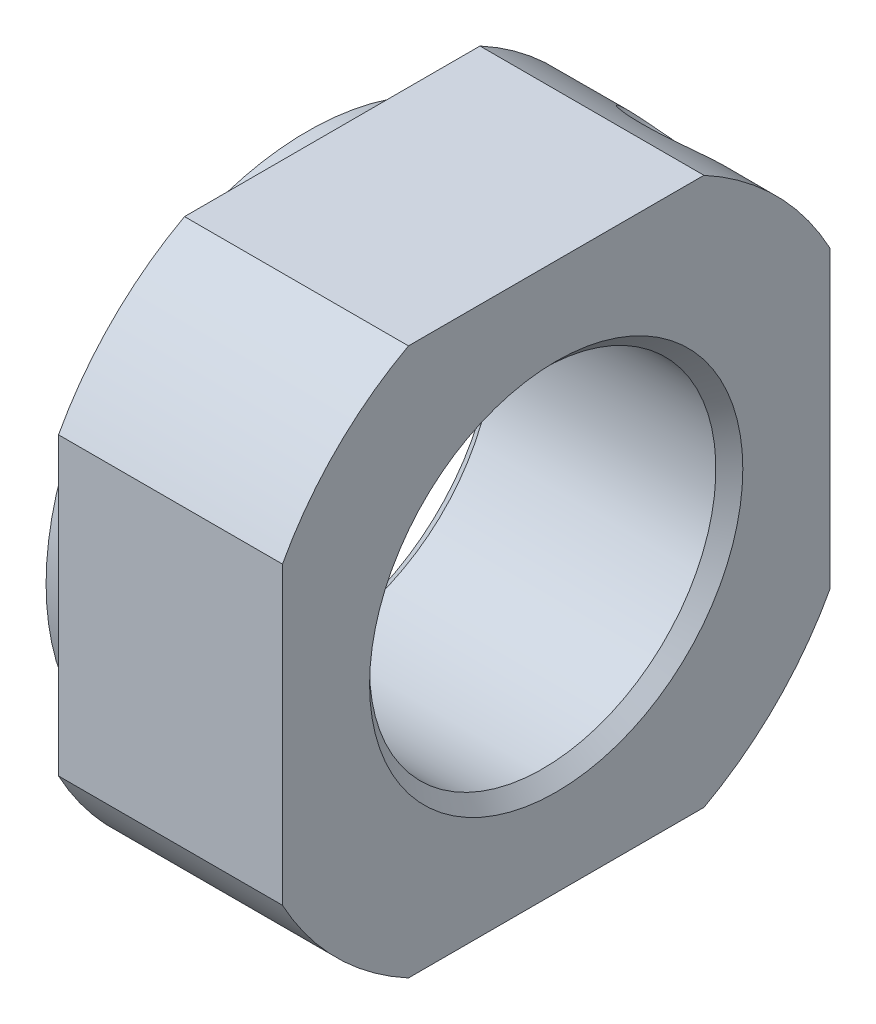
ISO-10303-21;
HEADER;
FILE_DESCRIPTION(('STEP AP214'),'2;1');
FILE_NAME('part.step','',(''),(''),'','','');
FILE_SCHEMA(('AUTOMOTIVE_DESIGN { 1 0 10303 214 1 1 1 1 }'));
ENDSEC;
DATA;
#1=APPLICATION_CONTEXT('core data for automotive mechanical design processes');
#2=APPLICATION_PROTOCOL_DEFINITION('international standard','automotive_design',2000,#1);
#3=PRODUCT_CONTEXT('',#1,'mechanical');
#4=PRODUCT('Part','Part','',(#3));
#5=PRODUCT_RELATED_PRODUCT_CATEGORY('part','',(#4));
#6=PRODUCT_DEFINITION_FORMATION('','',#4);
#7=PRODUCT_DEFINITION_CONTEXT('part definition',#1,'design');
#8=PRODUCT_DEFINITION('design','',#6,#7);
#9=PRODUCT_DEFINITION_SHAPE('','',#8);
#10=(LENGTH_UNIT() NAMED_UNIT(*) SI_UNIT(.MILLI.,.METRE.));
#11=(NAMED_UNIT(*) PLANE_ANGLE_UNIT() SI_UNIT($,.RADIAN.));
#12=(NAMED_UNIT(*) SI_UNIT($,.STERADIAN.) SOLID_ANGLE_UNIT());
#13=UNCERTAINTY_MEASURE_WITH_UNIT(LENGTH_MEASURE(1.E-05),#10,'distance_accuracy_value','');
#14=(GEOMETRIC_REPRESENTATION_CONTEXT(3) GLOBAL_UNCERTAINTY_ASSIGNED_CONTEXT((#13)) GLOBAL_UNIT_ASSIGNED_CONTEXT((#10,
#11,#12)) REPRESENTATION_CONTEXT('',''));
#15=CARTESIAN_POINT('',(0.,0.,0.));
#16=DIRECTION('',(0.,0.,1.));
#17=DIRECTION('',(1.,0.,0.));
#18=AXIS2_PLACEMENT_3D('',#15,#16,#17);
#19=CARTESIAN_POINT('',(9.,1.51441359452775E-12,-1.51441359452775E-12));
#20=DIRECTION('',(-1.,0.,0.));
#21=DIRECTION('',(0.,0.,1.));
#22=AXIS2_PLACEMENT_3D('',#19,#20,#21);
#23=CYLINDRICAL_SURFACE('',#22,12.499999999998);
#24=CARTESIAN_POINT('',(0.,1.51441359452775E-12,-1.51441359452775E-12));
#25=DIRECTION('',(1.,0.,0.));
#26=DIRECTION('',(0.,0.,-1.));
#27=AXIS2_PLACEMENT_3D('',#24,#25,#26);
#28=CIRCLE('',#27,12.499999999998);
#29=CARTESIAN_POINT('',(0.,5.937171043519,-11.));
#30=VERTEX_POINT('',#29);
#31=CARTESIAN_POINT('',(0.,11.,-5.937171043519));
#32=VERTEX_POINT('',#31);
#33=EDGE_CURVE('E148',#30,#32,#28,.T.);
#34=ORIENTED_EDGE('',*,*,#33,.T.);
#35=DIRECTION('',(-1.,0.,0.));
#36=VECTOR('',#35,1.);
#37=CARTESIAN_POINT('',(9.,11.,-5.937171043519));
#38=LINE('',#37,#36);
#39=CARTESIAN_POINT('',(9.,11.,-5.937171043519));
#40=VERTEX_POINT('',#39);
#41=EDGE_CURVE('E129',#40,#32,#38,.T.);
#42=ORIENTED_EDGE('',*,*,#41,.F.);
#43=CARTESIAN_POINT('',(9.,1.51441359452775E-12,-1.51441359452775E-12));
#44=DIRECTION('',(1.,0.,0.));
#45=DIRECTION('',(0.,0.,-1.));
#46=AXIS2_PLACEMENT_3D('',#43,#44,#45);
#47=CIRCLE('',#46,12.499999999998);
#48=CARTESIAN_POINT('',(9.,5.937171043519,-11.));
#49=VERTEX_POINT('',#48);
#50=EDGE_CURVE('E120',#49,#40,#47,.T.);
#51=ORIENTED_EDGE('',*,*,#50,.F.);
#52=DIRECTION('',(-1.,0.,0.));
#53=VECTOR('',#52,1.);
#54=CARTESIAN_POINT('',(9.,5.937171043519,-11.));
#55=LINE('',#54,#53);
#56=EDGE_CURVE('E157',#49,#30,#55,.T.);
#57=ORIENTED_EDGE('',*,*,#56,.T.);
#58=EDGE_LOOP('',(#34,#42,#51,#57));
#59=FACE_BOUND('',#58,.T.);
#60=CARTESIAN_POINT('',(3.46908361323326,7.95264681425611,-9.64393119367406));
#61=CARTESIAN_POINT('',(3.40467004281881,8.00792620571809,-9.59834578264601));
#62=CARTESIAN_POINT('',(3.34564206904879,8.06656085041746,-9.54919380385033));
#63=CARTESIAN_POINT('',(3.24011485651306,8.18908332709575,-9.44433226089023));
#64=CARTESIAN_POINT('',(3.19361898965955,8.25297256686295,-9.38862093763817));
#65=CARTESIAN_POINT('',(3.11154773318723,8.3896574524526,-9.26675132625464));
#66=CARTESIAN_POINT('',(3.07717708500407,8.46275411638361,-9.20011123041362));
#67=CARTESIAN_POINT('',(3.02658994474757,8.61057411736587,-9.06191119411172));
#68=CARTESIAN_POINT('',(3.01037050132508,8.68529718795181,-8.99035205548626));
#69=CARTESIAN_POINT('',(2.99727678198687,8.82925457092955,-8.84894488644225));
#70=CARTESIAN_POINT('',(2.9992870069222,8.89854652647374,-8.77925705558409));
#71=CARTESIAN_POINT('',(3.01991095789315,9.03424429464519,-8.6395549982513));
#72=CARTESIAN_POINT('',(3.03852197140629,9.10065057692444,-8.56954082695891));
#73=CARTESIAN_POINT('',(3.09114037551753,9.22787856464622,-8.4323714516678));
#74=CARTESIAN_POINT('',(3.12491139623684,9.2887693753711,-8.36518905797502));
#75=CARTESIAN_POINT('',(3.2064808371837,9.40481510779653,-8.2345066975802));
#76=CARTESIAN_POINT('',(3.25428157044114,9.45996908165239,-8.17100734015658));
#77=CARTESIAN_POINT('',(3.36464570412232,9.56591245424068,-8.04675590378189));
#78=CARTESIAN_POINT('',(3.42776164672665,9.61640692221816,-7.98624412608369));
#79=CARTESIAN_POINT('',(3.56547677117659,9.70955437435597,-7.87273503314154));
#80=CARTESIAN_POINT('',(3.64007942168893,9.75220498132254,-7.81973999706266));
#81=CARTESIAN_POINT('',(3.80440573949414,9.83208195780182,-7.71910572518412));
#82=CARTESIAN_POINT('',(3.89483142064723,9.86869657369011,-7.67212695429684));
#83=CARTESIAN_POINT('',(4.0839273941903,9.93227515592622,-7.58963960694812));
#84=CARTESIAN_POINT('',(4.18260011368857,9.95923626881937,-7.55413442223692));
#85=CARTESIAN_POINT('',(4.39198343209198,10.0047792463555,-7.49372559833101));
#86=CARTESIAN_POINT('',(4.50306103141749,10.0227352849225,-7.46961915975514));
#87=CARTESIAN_POINT('',(4.72862562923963,10.0475890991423,-7.43615418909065));
#88=CARTESIAN_POINT('',(4.84311327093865,10.0544847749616,-7.42679845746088));
#89=CARTESIAN_POINT('',(5.07613773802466,10.0572440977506,-7.42306221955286));
#90=CARTESIAN_POINT('',(5.19468713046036,10.0527484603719,-7.42916941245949));
#91=CARTESIAN_POINT('',(5.42885975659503,10.0319682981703,-7.45720532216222));
#92=CARTESIAN_POINT('',(5.5444827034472,10.0156826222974,-7.47913558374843));
#93=CARTESIAN_POINT('',(5.76975125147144,9.97130609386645,-7.53819713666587));
#94=CARTESIAN_POINT('',(5.87938099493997,9.94318548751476,-7.57536673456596));
#95=CARTESIAN_POINT('',(6.08897354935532,9.87524630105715,-7.66371989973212));
#96=CARTESIAN_POINT('',(6.188936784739,9.83542823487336,-7.71490285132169));
#97=CARTESIAN_POINT('',(6.37316871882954,9.74565608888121,-7.82797788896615));
#98=CARTESIAN_POINT('',(6.45779800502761,9.69601643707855,-7.88953064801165));
#99=CARTESIAN_POINT('',(6.61153742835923,9.58651968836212,-8.02221974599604));
#100=CARTESIAN_POINT('',(6.68065399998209,9.52666684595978,-8.09335209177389));
#101=CARTESIAN_POINT('',(6.79655056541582,9.40193061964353,-8.23785235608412));
#102=CARTESIAN_POINT('',(6.84447329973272,9.33761087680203,-8.31078893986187));
#103=CARTESIAN_POINT('',(6.92193488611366,9.20240844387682,-8.46024810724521));
#104=CARTESIAN_POINT('',(6.95148440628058,9.13152958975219,-8.53676858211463));
#105=CARTESIAN_POINT('',(6.98927821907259,8.99074769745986,-8.68482040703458));
#106=CARTESIAN_POINT('',(6.99895058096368,8.9211681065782,-8.75629689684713));
#107=CARTESIAN_POINT('',(7.00088650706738,8.78018692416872,-8.89765535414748));
#108=CARTESIAN_POINT('',(6.99315434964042,8.70878578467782,-8.96753770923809));
#109=CARTESIAN_POINT('',(6.96123166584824,8.56896839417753,-9.10119832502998));
#110=CARTESIAN_POINT('',(6.93764108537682,8.50053689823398,-9.16510560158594));
#111=CARTESIAN_POINT('',(6.87558226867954,8.36607288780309,-9.28800997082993));
#112=CARTESIAN_POINT('',(6.83711283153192,8.3000405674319,-9.34700666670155));
#113=CARTESIAN_POINT('',(6.74553023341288,8.17057068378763,-9.46041129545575));
#114=CARTESIAN_POINT('',(6.69206179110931,8.10724548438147,-9.51465970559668));
#115=CARTESIAN_POINT('',(6.57276726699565,7.98681462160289,-9.61597617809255));
#116=CARTESIAN_POINT('',(6.50693784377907,7.92971064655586,-9.66304229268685));
#117=CARTESIAN_POINT('',(6.36009559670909,7.81960814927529,-9.75238919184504));
#118=CARTESIAN_POINT('',(6.27836099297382,7.76714103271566,-9.79413807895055));
#119=CARTESIAN_POINT('',(6.10542346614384,7.67236660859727,-9.86855766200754));
#120=CARTESIAN_POINT('',(6.01421755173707,7.63006252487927,-9.90122547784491));
#121=CARTESIAN_POINT('',(5.81815804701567,7.55418170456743,-9.95925636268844));
#122=CARTESIAN_POINT('',(5.7127969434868,7.52140932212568,-9.9839592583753));
#123=CARTESIAN_POINT('',(5.49685331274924,7.46969192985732,-10.0227117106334));
#124=CARTESIAN_POINT('',(5.38626972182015,7.45074975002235,-10.0367590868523));
#125=CARTESIAN_POINT('',(5.15798077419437,7.42674360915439,-10.0545373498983));
#126=CARTESIAN_POINT('',(5.04017274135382,7.42230542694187,-10.0578031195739));
#127=CARTESIAN_POINT('',(4.80524572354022,7.42920786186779,-10.052705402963));
#128=CARTESIAN_POINT('',(4.68812692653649,7.44055259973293,-10.0443388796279));
#129=CARTESIAN_POINT('',(4.45647137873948,7.47889914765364,-10.0158196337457));
#130=CARTESIAN_POINT('',(4.3419829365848,7.50608851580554,-9.99552569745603));
#131=CARTESIAN_POINT('',(4.12050810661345,7.57539551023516,-9.94310112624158));
#132=CARTESIAN_POINT('',(4.01351714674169,7.61750394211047,-9.91097778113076));
#133=CARTESIAN_POINT('',(3.82982934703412,7.7059006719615,-9.8423363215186));
#134=CARTESIAN_POINT('',(3.75124686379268,7.74985945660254,-9.80782538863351));
#135=CARTESIAN_POINT('',(3.60301893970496,7.84564968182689,-9.7313684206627));
#136=CARTESIAN_POINT('',(3.53336917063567,7.89747728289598,-9.68942601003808));
#137=CARTESIAN_POINT('',(3.46908361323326,7.95264681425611,-9.64393119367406));
#138=B_SPLINE_CURVE_WITH_KNOTS('',3,(#60,#61,#62,#63,#64,#65,#66,#67,#68,#69,#70,#71,#72,#73,
#74,#75,#76,#77,#78,#79,#80,#81,#82,#83,#84,#85,#86,#87,#88,#89,#90,#91,#92,#93,#94,#95,#96,#97,
#98,#99,#100,#101,#102,#103,#104,#105,#106,#107,#108,#109,#110,#111,#112,#113,#114,#115,#116,
#117,#118,#119,#120,#121,#122,#123,#124,#125,#126,#127,#128,#129,#130,#131,#132,#133,#134,#135,
#136,#137),.UNSPECIFIED.,.T.,.F.,(4,2,2,2,2,2,2,2,2,2,2,2,2,2,2,2,2,2,2,2,2,2,2,2,2,2,2,2,2,2,2,
2,2,2,2,2,2,2,4),(0.,0.288765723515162,0.577609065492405,0.890084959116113,1.20251003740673,
1.49595279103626,1.78934760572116,2.07831875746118,2.36733757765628,2.66895099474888,
2.97065566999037,3.29408589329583,3.61761163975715,3.96126974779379,4.30499309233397,
4.65969156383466,5.01442466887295,5.37005497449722,5.72566965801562,6.07134432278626,
6.41687533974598,6.74038698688,7.06371061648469,7.36285406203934,7.66192398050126,
7.95027266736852,8.23864463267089,8.53452681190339,8.83048908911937,9.14628085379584,
9.46217265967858,9.79987742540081,10.137651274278,10.4898184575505,10.8420776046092,
11.1985937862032,11.554890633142,11.8432227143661,12.1314145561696),.UNSPECIFIED.);
#139=CARTESIAN_POINT('',(3.46908361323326,7.95264681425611,-9.64393119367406));
#140=VERTEX_POINT('',#139);
#141=EDGE_CURVE('E11',#140,#140,#138,.T.);
#142=ORIENTED_EDGE('',*,*,#141,.F.);
#143=EDGE_LOOP('',(#142));
#144=FACE_BOUND('',#143,.T.);
#145=ADVANCED_FACE('F35',(#59,#144),#23,.T.);
#146=CARTESIAN_POINT('',(9.,0.,0.));
#147=DIRECTION('',(-1.,0.,0.));
#148=DIRECTION('',(0.,0.,1.));
#149=AXIS2_PLACEMENT_3D('',#146,#147,#148);
#150=CYLINDRICAL_SURFACE('',#149,6.9585);
#151=CARTESIAN_POINT('',(8.4585,0.,0.));
#152=DIRECTION('',(-1.,0.,0.));
#153=DIRECTION('',(0.,0.,1.));
#154=AXIS2_PLACEMENT_3D('',#151,#152,#153);
#155=CIRCLE('',#154,6.9585);
#156=CARTESIAN_POINT('',(8.4585,0.,6.9585));
#157=VERTEX_POINT('',#156);
#158=EDGE_CURVE('E251',#157,#157,#155,.T.);
#159=ORIENTED_EDGE('',*,*,#158,.F.);
#160=EDGE_LOOP('',(#159));
#161=FACE_BOUND('',#160,.T.);
#162=CARTESIAN_POINT('',(-0.458500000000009,0.,0.));
#163=DIRECTION('',(-1.,0.,0.));
#164=DIRECTION('',(0.,0.,1.));
#165=AXIS2_PLACEMENT_3D('',#162,#163,#164);
#166=CIRCLE('',#165,6.9585);
#167=CARTESIAN_POINT('',(-0.458500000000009,0.,6.9585));
#168=VERTEX_POINT('',#167);
#169=EDGE_CURVE('E248',#168,#168,#166,.T.);
#170=ORIENTED_EDGE('',*,*,#169,.T.);
#171=EDGE_LOOP('',(#170));
#172=FACE_BOUND('',#171,.T.);
#173=CARTESIAN_POINT('',(5.,5.9312530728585,-3.6388128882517));
#174=CARTESIAN_POINT('',(5.08971664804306,5.93125231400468,-3.6388161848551));
#175=CARTESIAN_POINT('',(5.17946651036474,5.92724379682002,-3.64537288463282));
#176=CARTESIAN_POINT('',(5.35640295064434,5.91122841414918,-3.6712837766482));
#177=CARTESIAN_POINT('',(5.44358779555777,5.89921626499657,-3.690646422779));
#178=CARTESIAN_POINT('',(5.61280930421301,5.86728246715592,-3.74120372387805));
#179=CARTESIAN_POINT('',(5.69485191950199,5.84737016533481,-3.77238439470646));
#180=CARTESIAN_POINT('',(5.8517165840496,5.79975796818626,-3.8451805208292));
#181=CARTESIAN_POINT('',(5.9265385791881,5.77205801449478,-3.88679605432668));
#182=CARTESIAN_POINT('',(6.06827015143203,5.7085117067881,-3.97955052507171));
#183=CARTESIAN_POINT('',(6.13502132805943,5.67253331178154,-4.0308410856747));
#184=CARTESIAN_POINT('',(6.25732556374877,5.59302662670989,-4.14045307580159));
#185=CARTESIAN_POINT('',(6.31287767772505,5.54949770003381,-4.19877509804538));
#186=CARTESIAN_POINT('',(6.4118429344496,5.45485132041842,-4.32103665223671));
#187=CARTESIAN_POINT('',(6.45510228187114,5.40364901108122,-4.38503523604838));
#188=CARTESIAN_POINT('',(6.52725685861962,5.29492946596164,-4.51571234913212));
#189=CARTESIAN_POINT('',(6.55615392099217,5.23741303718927,-4.58239053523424));
#190=CARTESIAN_POINT('',(6.59826139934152,5.11840868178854,-4.71491273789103));
#191=CARTESIAN_POINT('',(6.61174031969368,5.05700903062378,-4.78075063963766));
#192=CARTESIAN_POINT('',(6.62346985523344,4.93096749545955,-4.91064832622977));
#193=CARTESIAN_POINT('',(6.62172243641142,4.86632603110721,-4.97470833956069));
#194=CARTESIAN_POINT('',(6.60324586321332,4.73700366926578,-5.09797503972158));
#195=CARTESIAN_POINT('',(6.58680629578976,4.67234757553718,-5.1572515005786));
#196=CARTESIAN_POINT('',(6.53987530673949,4.54380101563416,-5.2708592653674));
#197=CARTESIAN_POINT('',(6.50938319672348,4.47991058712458,-5.32519032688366));
#198=CARTESIAN_POINT('',(6.43496623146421,4.35448023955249,-5.42824764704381));
#199=CARTESIAN_POINT('',(6.39093457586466,4.29296355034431,-5.47692494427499));
#200=CARTESIAN_POINT('',(6.29076862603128,4.17493704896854,-5.56741969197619));
#201=CARTESIAN_POINT('',(6.2346324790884,4.11842800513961,-5.60923609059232));
#202=CARTESIAN_POINT('',(6.11028484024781,4.01119319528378,-5.68643347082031));
#203=CARTESIAN_POINT('',(6.04182001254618,3.96063505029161,-5.72163962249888));
#204=CARTESIAN_POINT('',(5.89557880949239,3.86891076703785,-5.78405902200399));
#205=CARTESIAN_POINT('',(5.81780210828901,3.82774495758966,-5.81127199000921));
#206=CARTESIAN_POINT('',(5.65471709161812,3.75646407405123,-5.85760381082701));
#207=CARTESIAN_POINT('',(5.5693817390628,3.72639083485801,-5.87669206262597));
#208=CARTESIAN_POINT('',(5.39385539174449,3.67896259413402,-5.90650061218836));
#209=CARTESIAN_POINT('',(5.30366528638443,3.66160527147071,-5.91722243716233));
#210=CARTESIAN_POINT('',(5.12321679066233,3.64073872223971,-5.93008363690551));
#211=CARTESIAN_POINT('',(5.03300787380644,3.63691957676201,-5.93241510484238));
#212=CARTESIAN_POINT('',(4.85315379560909,3.64245841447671,-5.92901588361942));
#213=CARTESIAN_POINT('',(4.7635085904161,3.65181535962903,-5.92328582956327));
#214=CARTESIAN_POINT('',(4.58859834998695,3.68301308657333,-5.90393619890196));
#215=CARTESIAN_POINT('',(4.50329000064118,3.70468021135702,-5.89042633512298));
#216=CARTESIAN_POINT('',(4.33805243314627,3.75935494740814,-5.85568230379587));
#217=CARTESIAN_POINT('',(4.25812378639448,3.79236376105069,-5.83444731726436));
#218=CARTESIAN_POINT('',(4.10439241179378,3.86895651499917,-5.78394590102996));
#219=CARTESIAN_POINT('',(4.03071936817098,3.91271329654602,-5.75454706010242));
#220=CARTESIAN_POINT('',(3.8929690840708,4.0087064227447,-5.68809243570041));
#221=CARTESIAN_POINT('',(3.82889320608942,4.06094396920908,-5.65103556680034));
#222=CARTESIAN_POINT('',(3.71075199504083,4.17311563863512,-5.5687306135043));
#223=CARTESIAN_POINT('',(3.65693025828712,4.23319055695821,-5.52332419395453));
#224=CARTESIAN_POINT('',(3.56257895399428,4.35788661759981,-5.42547857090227));
#225=CARTESIAN_POINT('',(3.52204872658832,4.42250753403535,-5.37303971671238));
#226=CARTESIAN_POINT('',(3.45575694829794,4.5535250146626,-5.26245411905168));
#227=CARTESIAN_POINT('',(3.42989539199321,4.61990624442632,-5.20434927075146));
#228=CARTESIAN_POINT('',(3.39336744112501,4.7525912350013,-5.08346779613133));
#229=CARTESIAN_POINT('',(3.38269852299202,4.81889500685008,-5.02069194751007));
#230=CARTESIAN_POINT('',(3.3769848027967,4.94775316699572,-4.89371559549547));
#231=CARTESIAN_POINT('',(3.38157822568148,5.01035907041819,-4.82958338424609));
#232=CARTESIAN_POINT('',(3.40544105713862,5.13172444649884,-4.70042348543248));
#233=CARTESIAN_POINT('',(3.42471012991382,5.19048400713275,-4.63539581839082));
#234=CARTESIAN_POINT('',(3.477194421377,5.30252971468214,-4.50678948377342));
#235=CARTESIAN_POINT('',(3.51035206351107,5.35583734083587,-4.44320596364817));
#236=CARTESIAN_POINT('',(3.58961834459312,5.4562538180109,-4.31930359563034));
#237=CARTESIAN_POINT('',(3.63572841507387,5.50336198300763,-4.25898510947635));
#238=CARTESIAN_POINT('',(3.74073681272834,5.59162963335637,-4.14244647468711));
#239=CARTESIAN_POINT('',(3.79988571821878,5.63264169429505,-4.08634043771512));
#240=CARTESIAN_POINT('',(3.92879553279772,5.70705354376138,-3.98175728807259));
#241=CARTESIAN_POINT('',(3.99855904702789,5.7404514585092,-3.93328205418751));
#242=CARTESIAN_POINT('',(4.14802947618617,5.7998157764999,-3.84522179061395));
#243=CARTESIAN_POINT('',(4.22787470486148,5.82565793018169,-3.80578747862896));
#244=CARTESIAN_POINT('',(4.39440005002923,5.86900826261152,-3.73859265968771));
#245=CARTESIAN_POINT('',(4.48107466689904,5.88652306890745,-3.71082287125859));
#246=CARTESIAN_POINT('',(4.639781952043,5.91028996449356,-3.67281603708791));
#247=CARTESIAN_POINT('',(4.71099521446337,5.91814737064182,-3.66010292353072));
#248=CARTESIAN_POINT('',(4.85479845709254,5.92862906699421,-3.64310028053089));
#249=CARTESIAN_POINT('',(4.92738835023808,5.93125368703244,-3.63881022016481));
#250=CARTESIAN_POINT('',(5.,5.9312530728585,-3.6388128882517));
#251=B_SPLINE_CURVE_WITH_KNOTS('',3,(#173,#174,#175,#176,#177,#178,#179,#180,#181,#182,#183,
#184,#185,#186,#187,#188,#189,#190,#191,#192,#193,#194,#195,#196,#197,#198,#199,#200,#201,#202,
#203,#204,#205,#206,#207,#208,#209,#210,#211,#212,#213,#214,#215,#216,#217,#218,#219,#220,#221,
#222,#223,#224,#225,#226,#227,#228,#229,#230,#231,#232,#233,#234,#235,#236,#237,#238,#239,#240,
#241,#242,#243,#244,#245,#246,#247,#248,#249,#250),.UNSPECIFIED.,.T.,.F.,(4,2,2,2,2,2,2,2,2,2,2,
2,2,2,2,2,2,2,2,2,2,2,2,2,2,2,2,2,2,2,2,2,2,2,2,2,2,2,4),(0.,0.268883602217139,
0.537944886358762,0.806688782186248,1.07543469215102,1.34880742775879,1.62220322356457,
1.89888236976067,2.17552619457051,2.44727523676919,2.71898919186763,2.98546288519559,
3.25194963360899,3.52059483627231,3.78928118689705,4.06429779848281,4.33932403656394,
4.61537716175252,4.8913798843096,5.16102196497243,5.43064280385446,5.69655137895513,
5.96248815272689,6.23301917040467,6.50358855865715,6.77994869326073,7.05629510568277,
7.33073412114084,7.60512754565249,7.87306364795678,8.1409936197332,8.40782368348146,
8.67468324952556,8.94720494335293,9.21979363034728,9.49664082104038,9.77326730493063,
9.99090041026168,10.2085197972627),.UNSPECIFIED.);
#252=CARTESIAN_POINT('',(5.,5.9312530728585,-3.6388128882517));
#253=VERTEX_POINT('',#252);
#254=EDGE_CURVE('E169',#253,#253,#251,.T.);
#255=ORIENTED_EDGE('',*,*,#254,.T.);
#256=EDGE_LOOP('',(#255));
#257=FACE_BOUND('',#256,.T.);
#258=ADVANCED_FACE('F177',(#161,#172,#257),#150,.F.);
#259=CARTESIAN_POINT('',(9.,1.51441359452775E-12,-1.51441359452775E-12));
#260=DIRECTION('',(1.,0.,0.));
#261=DIRECTION('',(0.,0.,-1.));
#262=AXIS2_PLACEMENT_3D('',#259,#260,#261);
#263=PLANE('',#262);
#264=CARTESIAN_POINT('',(9.,1.51441359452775E-12,-1.51441359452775E-12));
#265=DIRECTION('',(1.,0.,0.));
#266=DIRECTION('',(0.,0.,-1.));
#267=AXIS2_PLACEMENT_3D('',#264,#265,#266);
#268=CIRCLE('',#267,12.5000000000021);
#269=CARTESIAN_POINT('',(9.,-5.937171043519,11.));
#270=VERTEX_POINT('',#269);
#271=CARTESIAN_POINT('',(9.,-11.,5.937171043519));
#272=VERTEX_POINT('',#271);
#273=EDGE_CURVE('E153',#270,#272,#268,.T.);
#274=ORIENTED_EDGE('',*,*,#273,.T.);
#275=DIRECTION('',(0.,0.,-1.));
#276=VECTOR('',#275,1.);
#277=CARTESIAN_POINT('',(9.,-11.,5.937171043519));
#278=LINE('',#277,#276);
#279=CARTESIAN_POINT('',(9.,-10.9999999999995,-5.9371710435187));
#280=VERTEX_POINT('',#279);
#281=EDGE_CURVE('E100',#272,#280,#278,.T.);
#282=ORIENTED_EDGE('',*,*,#281,.T.);
#283=CARTESIAN_POINT('',(9.,1.51441359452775E-12,-1.51441359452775E-12));
#284=DIRECTION('',(1.,0.,0.));
#285=DIRECTION('',(0.,0.,-1.));
#286=AXIS2_PLACEMENT_3D('',#283,#284,#285);
#287=CIRCLE('',#286,12.5);
#288=CARTESIAN_POINT('',(9.,-5.937171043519,-11.));
#289=VERTEX_POINT('',#288);
#290=EDGE_CURVE('E231',#280,#289,#287,.T.);
#291=ORIENTED_EDGE('',*,*,#290,.T.);
#292=DIRECTION('',(0.,1.,0.));
#293=VECTOR('',#292,1.);
#294=CARTESIAN_POINT('',(9.,-5.937171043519,-11.));
#295=LINE('',#294,#293);
#296=EDGE_CURVE('E237',#289,#49,#295,.T.);
#297=ORIENTED_EDGE('',*,*,#296,.T.);
#298=ORIENTED_EDGE('',*,*,#50,.T.);
#299=DIRECTION('',(0.,0.,1.));
#300=VECTOR('',#299,1.);
#301=CARTESIAN_POINT('',(9.,11.,-5.937171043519));
#302=LINE('',#301,#300);
#303=CARTESIAN_POINT('',(9.,11.0000000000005,5.93717104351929));
#304=VERTEX_POINT('',#303);
#305=EDGE_CURVE('E113',#40,#304,#302,.T.);
#306=ORIENTED_EDGE('',*,*,#305,.T.);
#307=CARTESIAN_POINT('',(9.,1.51441359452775E-12,-1.51441359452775E-12));
#308=DIRECTION('',(1.,0.,0.));
#309=DIRECTION('',(0.,0.,-1.));
#310=AXIS2_PLACEMENT_3D('',#307,#308,#309);
#311=CIRCLE('',#310,12.5);
#312=CARTESIAN_POINT('',(9.,5.937171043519,11.));
#313=VERTEX_POINT('',#312);
#314=EDGE_CURVE('E118',#304,#313,#311,.T.);
#315=ORIENTED_EDGE('',*,*,#314,.T.);
#316=DIRECTION('',(0.,-1.,0.));
#317=VECTOR('',#316,1.);
#318=CARTESIAN_POINT('',(9.,5.937171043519,11.));
#319=LINE('',#318,#317);
#320=EDGE_CURVE('E56',#313,#270,#319,.T.);
#321=ORIENTED_EDGE('',*,*,#320,.T.);
#322=EDGE_LOOP('',(#274,#282,#291,#297,#298,#306,#315,#321));
#323=FACE_BOUND('',#322,.T.);
#324=CARTESIAN_POINT('',(9.,0.,0.));
#325=DIRECTION('',(-1.,0.,0.));
#326=DIRECTION('',(0.,0.,1.));
#327=AXIS2_PLACEMENT_3D('',#324,#325,#326);
#328=CIRCLE('',#327,7.5);
#329=CARTESIAN_POINT('',(9.,0.,7.5));
#330=VERTEX_POINT('',#329);
#331=EDGE_CURVE('E175',#330,#330,#328,.T.);
#332=ORIENTED_EDGE('',*,*,#331,.T.);
#333=EDGE_LOOP('',(#332));
#334=FACE_BOUND('',#333,.T.);
#335=ADVANCED_FACE('F115',(#323,#334),#263,.T.);
#336=CARTESIAN_POINT('',(-1.,0.,0.));
#337=DIRECTION('',(1.,0.,0.));
#338=DIRECTION('',(0.,0.,-1.));
#339=AXIS2_PLACEMENT_3D('',#336,#337,#338);
#340=PLANE('',#339);
#341=CARTESIAN_POINT('',(-1.,0.,0.));
#342=DIRECTION('',(-1.,0.,0.));
#343=DIRECTION('',(0.,0.,1.));
#344=AXIS2_PLACEMENT_3D('',#341,#342,#343);
#345=CIRCLE('',#344,10.5);
#346=CARTESIAN_POINT('',(-1.,0.,10.5));
#347=VERTEX_POINT('',#346);
#348=EDGE_CURVE('E142',#347,#347,#345,.T.);
#349=ORIENTED_EDGE('',*,*,#348,.T.);
#350=EDGE_LOOP('',(#349));
#351=FACE_BOUND('',#350,.T.);
#352=CARTESIAN_POINT('',(-0.999999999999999,0.,0.));
#353=DIRECTION('',(-1.,0.,0.));
#354=DIRECTION('',(0.,0.,1.));
#355=AXIS2_PLACEMENT_3D('',#352,#353,#354);
#356=CIRCLE('',#355,7.5);
#357=CARTESIAN_POINT('',(-0.999999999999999,0.,7.5));
#358=VERTEX_POINT('',#357);
#359=EDGE_CURVE('E245',#358,#358,#356,.T.);
#360=ORIENTED_EDGE('',*,*,#359,.F.);
#361=EDGE_LOOP('',(#360));
#362=FACE_BOUND('',#361,.T.);
#363=ADVANCED_FACE('F262',(#351,#362),#340,.F.);
#364=CARTESIAN_POINT('',(0.,1.51441359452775E-12,-1.51441359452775E-12));
#365=DIRECTION('',(1.,0.,0.));
#366=DIRECTION('',(0.,0.,-1.));
#367=AXIS2_PLACEMENT_3D('',#364,#365,#366);
#368=PLANE('',#367);
#369=CARTESIAN_POINT('',(0.,1.51441359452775E-12,-1.51441359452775E-12));
#370=DIRECTION('',(1.,0.,0.));
#371=DIRECTION('',(0.,0.,-1.));
#372=AXIS2_PLACEMENT_3D('',#369,#370,#371);
#373=CIRCLE('',#372,12.5000000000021);
#374=CARTESIAN_POINT('',(0.,-5.937171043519,11.));
#375=VERTEX_POINT('',#374);
#376=CARTESIAN_POINT('',(0.,-11.,5.937171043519));
#377=VERTEX_POINT('',#376);
#378=EDGE_CURVE('E138',#375,#377,#373,.T.);
#379=ORIENTED_EDGE('',*,*,#378,.F.);
#380=DIRECTION('',(0.,-1.,0.));
#381=VECTOR('',#380,1.);
#382=CARTESIAN_POINT('',(0.,5.937171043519,11.));
#383=LINE('',#382,#381);
#384=CARTESIAN_POINT('',(0.,5.937171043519,11.));
#385=VERTEX_POINT('',#384);
#386=EDGE_CURVE('E91',#385,#375,#383,.T.);
#387=ORIENTED_EDGE('',*,*,#386,.F.);
#388=CARTESIAN_POINT('',(0.,1.51441359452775E-12,-1.51441359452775E-12));
#389=DIRECTION('',(1.,0.,0.));
#390=DIRECTION('',(0.,0.,-1.));
#391=AXIS2_PLACEMENT_3D('',#388,#389,#390);
#392=CIRCLE('',#391,12.5);
#393=CARTESIAN_POINT('',(0.,11.0000000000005,5.93717104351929));
#394=VERTEX_POINT('',#393);
#395=EDGE_CURVE('E85',#394,#385,#392,.T.);
#396=ORIENTED_EDGE('',*,*,#395,.F.);
#397=DIRECTION('',(0.,0.,1.));
#398=VECTOR('',#397,1.);
#399=CARTESIAN_POINT('',(0.,11.,-5.937171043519));
#400=LINE('',#399,#398);
#401=EDGE_CURVE('E128',#32,#394,#400,.T.);
#402=ORIENTED_EDGE('',*,*,#401,.F.);
#403=ORIENTED_EDGE('',*,*,#33,.F.);
#404=DIRECTION('',(0.,1.,0.));
#405=VECTOR('',#404,1.);
#406=CARTESIAN_POINT('',(0.,-5.937171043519,-11.));
#407=LINE('',#406,#405);
#408=CARTESIAN_POINT('',(0.,-5.937171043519,-11.));
#409=VERTEX_POINT('',#408);
#410=EDGE_CURVE('E146',#409,#30,#407,.T.);
#411=ORIENTED_EDGE('',*,*,#410,.F.);
#412=CARTESIAN_POINT('',(0.,1.51441359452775E-12,-1.51441359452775E-12));
#413=DIRECTION('',(1.,0.,0.));
#414=DIRECTION('',(0.,0.,-1.));
#415=AXIS2_PLACEMENT_3D('',#412,#413,#414);
#416=CIRCLE('',#415,12.5);
#417=CARTESIAN_POINT('',(0.,-10.9999999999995,-5.9371710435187));
#418=VERTEX_POINT('',#417);
#419=EDGE_CURVE('E144',#418,#409,#416,.T.);
#420=ORIENTED_EDGE('',*,*,#419,.F.);
#421=DIRECTION('',(0.,0.,-1.));
#422=VECTOR('',#421,1.);
#423=CARTESIAN_POINT('',(0.,-11.,5.937171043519));
#424=LINE('',#423,#422);
#425=EDGE_CURVE('E141',#377,#418,#424,.T.);
#426=ORIENTED_EDGE('',*,*,#425,.F.);
#427=EDGE_LOOP('',(#379,#387,#396,#402,#403,#411,#420,#426));
#428=FACE_BOUND('',#427,.T.);
#429=CARTESIAN_POINT('',(0.,0.,0.));
#430=DIRECTION('',(1.,0.,0.));
#431=DIRECTION('',(0.,0.,-1.));
#432=AXIS2_PLACEMENT_3D('',#429,#430,#431);
#433=CIRCLE('',#432,10.5);
#434=CARTESIAN_POINT('',(0.,0.,-10.5));
#435=VERTEX_POINT('',#434);
#436=EDGE_CURVE('E48',#435,#435,#433,.F.);
#437=ORIENTED_EDGE('',*,*,#436,.F.);
#438=EDGE_LOOP('',(#437));
#439=FACE_BOUND('',#438,.T.);
#440=ADVANCED_FACE('F223',(#428,#439),#368,.F.);
#441=CARTESIAN_POINT('',(9.,1.51441359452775E-12,-1.51441359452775E-12));
#442=DIRECTION('',(-1.,0.,0.));
#443=DIRECTION('',(0.,0.,1.));
#444=AXIS2_PLACEMENT_3D('',#441,#442,#443);
#445=CYLINDRICAL_SURFACE('',#444,12.5000000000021);
#446=ORIENTED_EDGE('',*,*,#378,.T.);
#447=DIRECTION('',(-1.,0.,0.));
#448=VECTOR('',#447,1.);
#449=CARTESIAN_POINT('',(9.,-11.,5.937171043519));
#450=LINE('',#449,#448);
#451=EDGE_CURVE('E166',#272,#377,#450,.T.);
#452=ORIENTED_EDGE('',*,*,#451,.F.);
#453=ORIENTED_EDGE('',*,*,#273,.F.);
#454=DIRECTION('',(-1.,0.,0.));
#455=VECTOR('',#454,1.);
#456=CARTESIAN_POINT('',(9.,-5.937171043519,11.));
#457=LINE('',#456,#455);
#458=EDGE_CURVE('E134',#270,#375,#457,.T.);
#459=ORIENTED_EDGE('',*,*,#458,.T.);
#460=EDGE_LOOP('',(#446,#452,#453,#459));
#461=FACE_BOUND('',#460,.T.);
#462=ADVANCED_FACE('F37',(#461),#445,.T.);
#463=CARTESIAN_POINT('',(9.,-11.,5.937171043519));
#464=DIRECTION('',(0.,1.,0.));
#465=DIRECTION('',(0.,0.,1.));
#466=AXIS2_PLACEMENT_3D('',#463,#464,#465);
#467=PLANE('',#466);
#468=ORIENTED_EDGE('',*,*,#425,.T.);
#469=DIRECTION('',(-1.,0.,0.));
#470=VECTOR('',#469,1.);
#471=CARTESIAN_POINT('',(9.,-10.9999999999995,-5.9371710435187));
#472=LINE('',#471,#470);
#473=EDGE_CURVE('E163',#280,#418,#472,.T.);
#474=ORIENTED_EDGE('',*,*,#473,.F.);
#475=ORIENTED_EDGE('',*,*,#281,.F.);
#476=ORIENTED_EDGE('',*,*,#451,.T.);
#477=EDGE_LOOP('',(#468,#474,#475,#476));
#478=FACE_BOUND('',#477,.T.);
#479=ADVANCED_FACE('F217',(#478),#467,.F.);
#480=CARTESIAN_POINT('',(9.,1.51441359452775E-12,-1.51441359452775E-12));
#481=DIRECTION('',(-1.,0.,0.));
#482=DIRECTION('',(0.,0.,1.));
#483=AXIS2_PLACEMENT_3D('',#480,#481,#482);
#484=CYLINDRICAL_SURFACE('',#483,12.5);
#485=ORIENTED_EDGE('',*,*,#419,.T.);
#486=DIRECTION('',(-1.,0.,0.));
#487=VECTOR('',#486,1.);
#488=CARTESIAN_POINT('',(9.,-5.937171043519,-11.));
#489=LINE('',#488,#487);
#490=EDGE_CURVE('E160',#289,#409,#489,.T.);
#491=ORIENTED_EDGE('',*,*,#490,.F.);
#492=ORIENTED_EDGE('',*,*,#290,.F.);
#493=ORIENTED_EDGE('',*,*,#473,.T.);
#494=EDGE_LOOP('',(#485,#491,#492,#493));
#495=FACE_BOUND('',#494,.T.);
#496=ADVANCED_FACE('F214',(#495),#484,.T.);
#497=CARTESIAN_POINT('',(9.,-5.937171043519,-11.));
#498=DIRECTION('',(0.,0.,1.));
#499=DIRECTION('',(1.,0.,0.));
#500=AXIS2_PLACEMENT_3D('',#497,#498,#499);
#501=PLANE('',#500);
#502=ORIENTED_EDGE('',*,*,#410,.T.);
#503=ORIENTED_EDGE('',*,*,#56,.F.);
#504=ORIENTED_EDGE('',*,*,#296,.F.);
#505=ORIENTED_EDGE('',*,*,#490,.T.);
#506=EDGE_LOOP('',(#502,#503,#504,#505));
#507=FACE_BOUND('',#506,.T.);
#508=ADVANCED_FACE('F211',(#507),#501,.F.);
#509=CARTESIAN_POINT('',(9.,11.,-5.937171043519));
#510=DIRECTION('',(0.,-1.,0.));
#511=DIRECTION('',(0.,0.,-1.));
#512=AXIS2_PLACEMENT_3D('',#509,#510,#511);
#513=PLANE('',#512);
#514=ORIENTED_EDGE('',*,*,#401,.T.);
#515=DIRECTION('',(-1.,0.,0.));
#516=VECTOR('',#515,1.);
#517=CARTESIAN_POINT('',(9.,11.0000000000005,5.93717104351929));
#518=LINE('',#517,#516);
#519=EDGE_CURVE('E125',#304,#394,#518,.T.);
#520=ORIENTED_EDGE('',*,*,#519,.F.);
#521=ORIENTED_EDGE('',*,*,#305,.F.);
#522=ORIENTED_EDGE('',*,*,#41,.T.);
#523=EDGE_LOOP('',(#514,#520,#521,#522));
#524=FACE_BOUND('',#523,.T.);
#525=ADVANCED_FACE('F126',(#524),#513,.F.);
#526=CARTESIAN_POINT('',(9.,1.51441359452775E-12,-1.51441359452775E-12));
#527=DIRECTION('',(-1.,0.,0.));
#528=DIRECTION('',(0.,0.,1.));
#529=AXIS2_PLACEMENT_3D('',#526,#527,#528);
#530=CYLINDRICAL_SURFACE('',#529,12.5);
#531=ORIENTED_EDGE('',*,*,#395,.T.);
#532=DIRECTION('',(-1.,0.,0.));
#533=VECTOR('',#532,1.);
#534=CARTESIAN_POINT('',(9.,5.937171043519,11.));
#535=LINE('',#534,#533);
#536=EDGE_CURVE('E130',#313,#385,#535,.T.);
#537=ORIENTED_EDGE('',*,*,#536,.F.);
#538=ORIENTED_EDGE('',*,*,#314,.F.);
#539=ORIENTED_EDGE('',*,*,#519,.T.);
#540=EDGE_LOOP('',(#531,#537,#538,#539));
#541=FACE_BOUND('',#540,.T.);
#542=ADVANCED_FACE('F132',(#541),#530,.T.);
#543=CARTESIAN_POINT('',(9.,5.937171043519,11.));
#544=DIRECTION('',(0.,0.,-1.));
#545=DIRECTION('',(-1.,0.,0.));
#546=AXIS2_PLACEMENT_3D('',#543,#544,#545);
#547=PLANE('',#546);
#548=ORIENTED_EDGE('',*,*,#386,.T.);
#549=ORIENTED_EDGE('',*,*,#458,.F.);
#550=ORIENTED_EDGE('',*,*,#320,.F.);
#551=ORIENTED_EDGE('',*,*,#536,.T.);
#552=EDGE_LOOP('',(#548,#549,#550,#551));
#553=FACE_BOUND('',#552,.T.);
#554=ADVANCED_FACE('F273',(#553),#547,.F.);
#555=CARTESIAN_POINT('',(0.,0.,0.));
#556=DIRECTION('',(-1.,0.,0.));
#557=DIRECTION('',(0.,0.,1.));
#558=AXIS2_PLACEMENT_3D('',#555,#556,#557);
#559=CYLINDRICAL_SURFACE('',#558,10.5);
#560=ORIENTED_EDGE('',*,*,#348,.F.);
#561=EDGE_LOOP('',(#560));
#562=FACE_BOUND('',#561,.T.);
#563=ORIENTED_EDGE('',*,*,#436,.T.);
#564=EDGE_LOOP('',(#563));
#565=FACE_BOUND('',#564,.T.);
#566=ADVANCED_FACE('F196',(#562,#565),#559,.T.);
#567=CARTESIAN_POINT('',(-0.458500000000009,0.,0.));
#568=DIRECTION('',(-1.,0.,0.));
#569=DIRECTION('',(0.,0.,1.));
#570=AXIS2_PLACEMENT_3D('',#567,#568,#569);
#571=CONICAL_SURFACE('',#570,6.9585,0.785398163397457);
#572=ORIENTED_EDGE('',*,*,#359,.T.);
#573=EDGE_LOOP('',(#572));
#574=FACE_BOUND('',#573,.T.);
#575=ORIENTED_EDGE('',*,*,#169,.F.);
#576=EDGE_LOOP('',(#575));
#577=FACE_BOUND('',#576,.T.);
#578=ADVANCED_FACE('F191',(#574,#577),#571,.F.);
#579=CARTESIAN_POINT('',(9.,0.,0.));
#580=DIRECTION('',(1.,0.,0.));
#581=DIRECTION('',(0.,0.,-1.));
#582=AXIS2_PLACEMENT_3D('',#579,#580,#581);
#583=CONICAL_SURFACE('',#582,7.5,0.785398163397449);
#584=ORIENTED_EDGE('',*,*,#158,.T.);
#585=EDGE_LOOP('',(#584));
#586=FACE_BOUND('',#585,.T.);
#587=ORIENTED_EDGE('',*,*,#331,.F.);
#588=EDGE_LOOP('',(#587));
#589=FACE_BOUND('',#588,.T.);
#590=ADVANCED_FACE('F188',(#586,#589),#583,.F.);
#591=CARTESIAN_POINT('',(5.,8.5708412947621,-8.5708412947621));
#592=DIRECTION('',(0.,0.707106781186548,-0.707106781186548));
#593=DIRECTION('',(0.,0.707106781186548,0.707106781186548));
#594=AXIS2_PLACEMENT_3D('',#591,#592,#593);
#595=CONICAL_SURFACE('',#594,1.62100000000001,0.785398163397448);
#596=CARTESIAN_POINT('',(5.,8.5708412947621,-8.5708412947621));
#597=DIRECTION('',(0.,0.707106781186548,-0.707106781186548));
#598=DIRECTION('',(0.,0.707106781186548,0.707106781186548));
#599=AXIS2_PLACEMENT_3D('',#596,#597,#598);
#600=CIRCLE('',#599,1.62100000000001);
#601=CARTESIAN_POINT('',(5.,9.7170613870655,-7.4246212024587));
#602=VERTEX_POINT('',#601);
#603=EDGE_CURVE('E176',#602,#602,#600,.T.);
#604=ORIENTED_EDGE('',*,*,#603,.F.);
#605=EDGE_LOOP('',(#604));
#606=FACE_BOUND('',#605,.T.);
#607=ORIENTED_EDGE('',*,*,#141,.T.);
#608=EDGE_LOOP('',(#607));
#609=FACE_BOUND('',#608,.T.);
#610=ADVANCED_FACE('F184',(#606,#609),#595,.F.);
#611=CARTESIAN_POINT('',(5.,0.,0.));
#612=DIRECTION('',(0.,0.707106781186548,-0.707106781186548));
#613=DIRECTION('',(0.,0.707106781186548,0.707106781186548));
#614=AXIS2_PLACEMENT_3D('',#611,#612,#613);
#615=CYLINDRICAL_SURFACE('',#614,1.62100000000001);
#616=ORIENTED_EDGE('',*,*,#254,.F.);
#617=EDGE_LOOP('',(#616));
#618=FACE_BOUND('',#617,.T.);
#619=ORIENTED_EDGE('',*,*,#603,.T.);
#620=EDGE_LOOP('',(#619));
#621=FACE_BOUND('',#620,.T.);
#622=ADVANCED_FACE('F181',(#618,#621),#615,.F.);
#623=CLOSED_SHELL('',(#145,#258,#335,#363,#440,#462,#479,#496,#508,#525,#542,#554,#566,#578,
#590,#610,#622));
#624=MANIFOLD_SOLID_BREP('B2',#623);
#625=ADVANCED_BREP_SHAPE_REPRESENTATION('',(#18,#624),#14);
#626=SHAPE_DEFINITION_REPRESENTATION(#9,#625);
ENDSEC;
END-ISO-10303-21;
